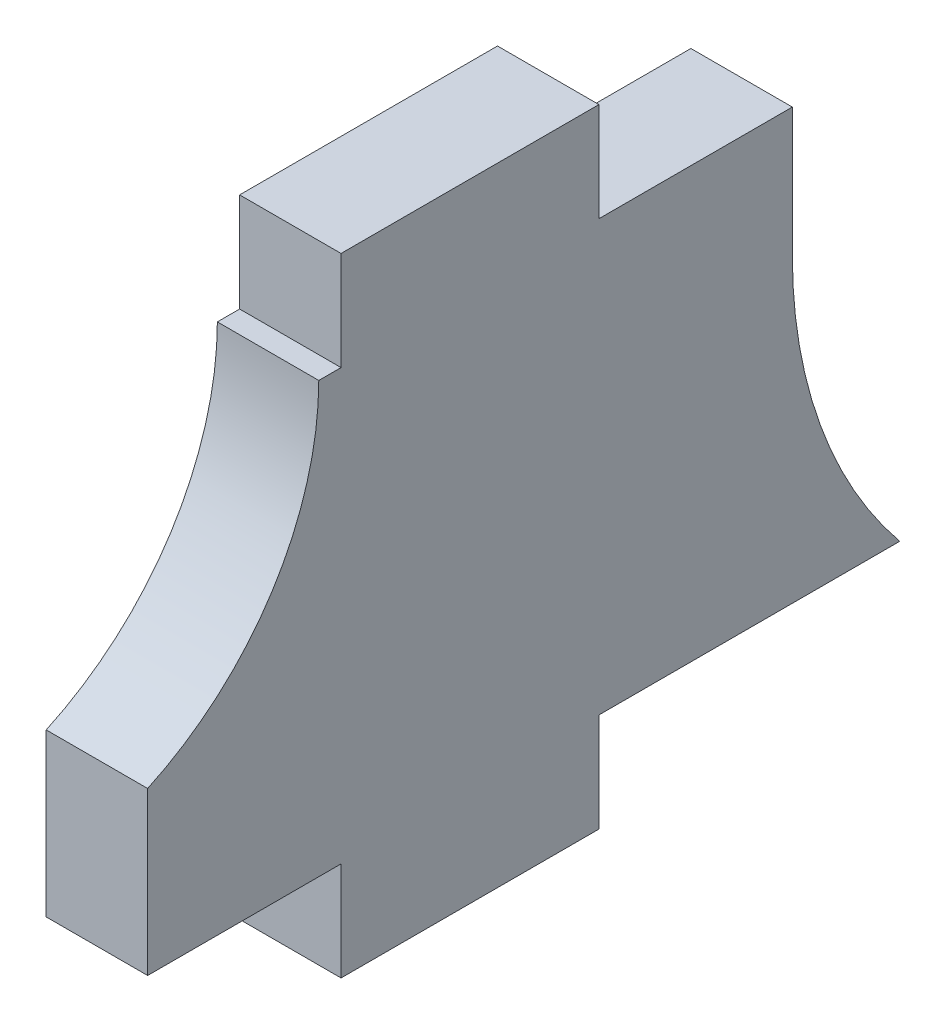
ISO-10303-21;
HEADER;
FILE_DESCRIPTION(('STEP AP214'),'2;1');
FILE_NAME('part.step','',(''),(''),'','','');
FILE_SCHEMA(('AUTOMOTIVE_DESIGN { 1 0 10303 214 1 1 1 1 }'));
ENDSEC;
DATA;
#1=APPLICATION_CONTEXT('core data for automotive mechanical design processes');
#2=APPLICATION_PROTOCOL_DEFINITION('international standard','automotive_design',2000,#1);
#3=PRODUCT_CONTEXT('',#1,'mechanical');
#4=PRODUCT('Part','Part','',(#3));
#5=PRODUCT_RELATED_PRODUCT_CATEGORY('part','',(#4));
#6=PRODUCT_DEFINITION_FORMATION('','',#4);
#7=PRODUCT_DEFINITION_CONTEXT('part definition',#1,'design');
#8=PRODUCT_DEFINITION('design','',#6,#7);
#9=PRODUCT_DEFINITION_SHAPE('','',#8);
#10=(LENGTH_UNIT() NAMED_UNIT(*) SI_UNIT(.MILLI.,.METRE.));
#11=(NAMED_UNIT(*) PLANE_ANGLE_UNIT() SI_UNIT($,.RADIAN.));
#12=(NAMED_UNIT(*) SI_UNIT($,.STERADIAN.) SOLID_ANGLE_UNIT());
#13=UNCERTAINTY_MEASURE_WITH_UNIT(LENGTH_MEASURE(1.E-05),#10,'distance_accuracy_value','');
#14=(GEOMETRIC_REPRESENTATION_CONTEXT(3) GLOBAL_UNCERTAINTY_ASSIGNED_CONTEXT((#13)) GLOBAL_UNIT_ASSIGNED_CONTEXT((#10,
#11,#12)) REPRESENTATION_CONTEXT('',''));
#15=CARTESIAN_POINT('',(0.,0.,0.));
#16=DIRECTION('',(0.,0.,1.));
#17=DIRECTION('',(1.,0.,0.));
#18=AXIS2_PLACEMENT_3D('',#15,#16,#17);
#19=CARTESIAN_POINT('',(2.9972,10.3531475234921,-23.5659141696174));
#20=DIRECTION('',(-1.,0.,0.));
#21=DIRECTION('',(0.,0.,1.));
#22=AXIS2_PLACEMENT_3D('',#19,#20,#21);
#23=CYLINDRICAL_SURFACE('',#22,14.0409141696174);
#24=CARTESIAN_POINT('',(0.,10.3531475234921,-23.5659141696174));
#25=DIRECTION('',(1.,0.,0.));
#26=DIRECTION('',(0.,0.,-1.));
#27=AXIS2_PLACEMENT_3D('',#24,#25,#26);
#28=CIRCLE('',#27,14.0409141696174);
#29=CARTESIAN_POINT('',(0.,10.3531475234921,-9.525));
#30=VERTEX_POINT('',#29);
#31=CARTESIAN_POINT('',(0.,1.4605,-12.7));
#32=VERTEX_POINT('',#31);
#33=EDGE_CURVE('E166',#30,#32,#28,.T.);
#34=ORIENTED_EDGE('',*,*,#33,.F.);
#35=DIRECTION('',(-1.,0.,0.));
#36=VECTOR('',#35,1.);
#37=CARTESIAN_POINT('',(2.9972,10.3531475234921,-9.525));
#38=LINE('',#37,#36);
#39=CARTESIAN_POINT('',(2.9972,10.3531475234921,-9.525));
#40=VERTEX_POINT('',#39);
#41=EDGE_CURVE('E11',#40,#30,#38,.T.);
#42=ORIENTED_EDGE('',*,*,#41,.F.);
#43=CARTESIAN_POINT('',(2.9972,10.3531475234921,-23.5659141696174));
#44=DIRECTION('',(1.,0.,0.));
#45=DIRECTION('',(0.,0.,-1.));
#46=AXIS2_PLACEMENT_3D('',#43,#44,#45);
#47=CIRCLE('',#46,14.0409141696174);
#48=CARTESIAN_POINT('',(2.9972,1.4605,-12.7));
#49=VERTEX_POINT('',#48);
#50=EDGE_CURVE('E260',#40,#49,#47,.T.);
#51=ORIENTED_EDGE('',*,*,#50,.T.);
#52=DIRECTION('',(-1.,0.,0.));
#53=VECTOR('',#52,1.);
#54=CARTESIAN_POINT('',(2.9972,1.4605,-12.7));
#55=LINE('',#54,#53);
#56=EDGE_CURVE('E51',#49,#32,#55,.T.);
#57=ORIENTED_EDGE('',*,*,#56,.T.);
#58=EDGE_LOOP('',(#34,#42,#51,#57));
#59=FACE_BOUND('',#58,.T.);
#60=ADVANCED_FACE('F35',(#59),#23,.F.);
#61=CARTESIAN_POINT('',(2.9972,0.,-9.525));
#62=DIRECTION('',(0.,0.,1.));
#63=DIRECTION('',(1.,0.,0.));
#64=AXIS2_PLACEMENT_3D('',#61,#62,#63);
#65=PLANE('',#64);
#66=DIRECTION('',(0.,1.,0.));
#67=VECTOR('',#66,1.);
#68=CARTESIAN_POINT('',(0.,0.,-9.525));
#69=LINE('',#68,#67);
#70=CARTESIAN_POINT('',(0.,14.1605,-9.525));
#71=VERTEX_POINT('',#70);
#72=EDGE_CURVE('E168',#30,#71,#69,.T.);
#73=ORIENTED_EDGE('',*,*,#72,.T.);
#74=DIRECTION('',(-1.,0.,0.));
#75=VECTOR('',#74,1.);
#76=CARTESIAN_POINT('',(2.9972,14.1605,-9.525));
#77=LINE('',#76,#75);
#78=CARTESIAN_POINT('',(2.9972,14.1605,-9.525));
#79=VERTEX_POINT('',#78);
#80=EDGE_CURVE('E43',#79,#71,#77,.T.);
#81=ORIENTED_EDGE('',*,*,#80,.F.);
#82=DIRECTION('',(0.,1.,0.));
#83=VECTOR('',#82,1.);
#84=CARTESIAN_POINT('',(2.9972,0.,-9.525));
#85=LINE('',#84,#83);
#86=EDGE_CURVE('E243',#40,#79,#85,.T.);
#87=ORIENTED_EDGE('',*,*,#86,.F.);
#88=ORIENTED_EDGE('',*,*,#41,.T.);
#89=EDGE_LOOP('',(#73,#81,#87,#88));
#90=FACE_BOUND('',#89,.T.);
#91=ADVANCED_FACE('F262',(#90),#65,.F.);
#92=CARTESIAN_POINT('',(2.9972,14.1605,0.));
#93=DIRECTION('',(0.,-1.,0.));
#94=DIRECTION('',(0.,0.,-1.));
#95=AXIS2_PLACEMENT_3D('',#92,#93,#94);
#96=PLANE('',#95);
#97=DIRECTION('',(0.,0.,1.));
#98=VECTOR('',#97,1.);
#99=CARTESIAN_POINT('',(0.,14.1605,0.));
#100=LINE('',#99,#98);
#101=CARTESIAN_POINT('',(0.,14.1605,-3.81000000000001));
#102=VERTEX_POINT('',#101);
#103=EDGE_CURVE('E170',#71,#102,#100,.T.);
#104=ORIENTED_EDGE('',*,*,#103,.T.);
#105=DIRECTION('',(-1.,0.,0.));
#106=VECTOR('',#105,1.);
#107=CARTESIAN_POINT('',(2.9972,14.1605,-3.81000000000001));
#108=LINE('',#107,#106);
#109=CARTESIAN_POINT('',(2.9972,14.1605,-3.81000000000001));
#110=VERTEX_POINT('',#109);
#111=EDGE_CURVE('E216',#110,#102,#108,.T.);
#112=ORIENTED_EDGE('',*,*,#111,.F.);
#113=DIRECTION('',(0.,0.,1.));
#114=VECTOR('',#113,1.);
#115=CARTESIAN_POINT('',(2.9972,14.1605,0.));
#116=LINE('',#115,#114);
#117=EDGE_CURVE('E224',#79,#110,#116,.T.);
#118=ORIENTED_EDGE('',*,*,#117,.F.);
#119=ORIENTED_EDGE('',*,*,#80,.T.);
#120=EDGE_LOOP('',(#104,#112,#118,#119));
#121=FACE_BOUND('',#120,.T.);
#122=ADVANCED_FACE('F222',(#121),#96,.F.);
#123=CARTESIAN_POINT('',(2.9972,0.,-3.81000000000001));
#124=DIRECTION('',(0.,0.,-1.));
#125=DIRECTION('',(-1.,0.,0.));
#126=AXIS2_PLACEMENT_3D('',#123,#124,#125);
#127=PLANE('',#126);
#128=DIRECTION('',(0.,-1.,0.));
#129=VECTOR('',#128,1.);
#130=CARTESIAN_POINT('',(0.,0.,-3.81000000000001));
#131=LINE('',#130,#129);
#132=CARTESIAN_POINT('',(0.,17.0815,-3.81000000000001));
#133=VERTEX_POINT('',#132);
#134=EDGE_CURVE('E173',#133,#102,#131,.T.);
#135=ORIENTED_EDGE('',*,*,#134,.F.);
#136=DIRECTION('',(-1.,0.,0.));
#137=VECTOR('',#136,1.);
#138=CARTESIAN_POINT('',(2.9972,17.0815,-3.81000000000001));
#139=LINE('',#138,#137);
#140=CARTESIAN_POINT('',(2.9972,17.0815,-3.81000000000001));
#141=VERTEX_POINT('',#140);
#142=EDGE_CURVE('E214',#141,#133,#139,.T.);
#143=ORIENTED_EDGE('',*,*,#142,.F.);
#144=DIRECTION('',(0.,-1.,0.));
#145=VECTOR('',#144,1.);
#146=CARTESIAN_POINT('',(2.9972,0.,-3.81000000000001));
#147=LINE('',#146,#145);
#148=EDGE_CURVE('E236',#141,#110,#147,.T.);
#149=ORIENTED_EDGE('',*,*,#148,.T.);
#150=ORIENTED_EDGE('',*,*,#111,.T.);
#151=EDGE_LOOP('',(#135,#143,#149,#150));
#152=FACE_BOUND('',#151,.T.);
#153=ADVANCED_FACE('F233',(#152),#127,.T.);
#154=CARTESIAN_POINT('',(2.9972,17.0815,0.));
#155=DIRECTION('',(0.,1.,0.));
#156=DIRECTION('',(0.,0.,1.));
#157=AXIS2_PLACEMENT_3D('',#154,#155,#156);
#158=PLANE('',#157);
#159=DIRECTION('',(0.,0.,-1.));
#160=VECTOR('',#159,1.);
#161=CARTESIAN_POINT('',(0.,17.0815,0.));
#162=LINE('',#161,#160);
#163=CARTESIAN_POINT('',(0.,17.0815,3.80999999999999));
#164=VERTEX_POINT('',#163);
#165=EDGE_CURVE('E177',#164,#133,#162,.T.);
#166=ORIENTED_EDGE('',*,*,#165,.F.);
#167=DIRECTION('',(-1.,0.,0.));
#168=VECTOR('',#167,1.);
#169=CARTESIAN_POINT('',(2.9972,17.0815,3.80999999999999));
#170=LINE('',#169,#168);
#171=CARTESIAN_POINT('',(2.9972,17.0815,3.80999999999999));
#172=VERTEX_POINT('',#171);
#173=EDGE_CURVE('E212',#172,#164,#170,.T.);
#174=ORIENTED_EDGE('',*,*,#173,.F.);
#175=DIRECTION('',(0.,0.,-1.));
#176=VECTOR('',#175,1.);
#177=CARTESIAN_POINT('',(2.9972,17.0815,0.));
#178=LINE('',#177,#176);
#179=EDGE_CURVE('E239',#172,#141,#178,.T.);
#180=ORIENTED_EDGE('',*,*,#179,.T.);
#181=ORIENTED_EDGE('',*,*,#142,.T.);
#182=EDGE_LOOP('',(#166,#174,#180,#181));
#183=FACE_BOUND('',#182,.T.);
#184=ADVANCED_FACE('F273',(#183),#158,.T.);
#185=CARTESIAN_POINT('',(2.9972,0.,3.80999999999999));
#186=DIRECTION('',(0.,0.,-1.));
#187=DIRECTION('',(-1.,0.,0.));
#188=AXIS2_PLACEMENT_3D('',#185,#186,#187);
#189=PLANE('',#188);
#190=DIRECTION('',(0.,-1.,0.));
#191=VECTOR('',#190,1.);
#192=CARTESIAN_POINT('',(0.,0.,3.80999999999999));
#193=LINE('',#192,#191);
#194=CARTESIAN_POINT('',(0.,14.1605,3.80999999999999));
#195=VERTEX_POINT('',#194);
#196=EDGE_CURVE('E180',#164,#195,#193,.T.);
#197=ORIENTED_EDGE('',*,*,#196,.T.);
#198=DIRECTION('',(-1.,0.,0.));
#199=VECTOR('',#198,1.);
#200=CARTESIAN_POINT('',(2.9972,14.1605,3.80999999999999));
#201=LINE('',#200,#199);
#202=CARTESIAN_POINT('',(2.9972,14.1605,3.80999999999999));
#203=VERTEX_POINT('',#202);
#204=EDGE_CURVE('E209',#203,#195,#201,.T.);
#205=ORIENTED_EDGE('',*,*,#204,.F.);
#206=DIRECTION('',(0.,-1.,0.));
#207=VECTOR('',#206,1.);
#208=CARTESIAN_POINT('',(2.9972,0.,3.80999999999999));
#209=LINE('',#208,#207);
#210=EDGE_CURVE('E241',#172,#203,#209,.T.);
#211=ORIENTED_EDGE('',*,*,#210,.F.);
#212=ORIENTED_EDGE('',*,*,#173,.T.);
#213=EDGE_LOOP('',(#197,#205,#211,#212));
#214=FACE_BOUND('',#213,.T.);
#215=ADVANCED_FACE('F276',(#214),#189,.F.);
#216=CARTESIAN_POINT('',(0.,14.1605,4.46810387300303));
#217=VERTEX_POINT('',#216);
#218=EDGE_CURVE('E174',#195,#217,#100,.T.);
#219=ORIENTED_EDGE('',*,*,#218,.T.);
#220=DIRECTION('',(-1.,0.,0.));
#221=VECTOR('',#220,1.);
#222=CARTESIAN_POINT('',(2.9972,14.1605,4.46810387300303));
#223=LINE('',#222,#221);
#224=CARTESIAN_POINT('',(2.9972,14.1605,4.46810387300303));
#225=VERTEX_POINT('',#224);
#226=EDGE_CURVE('E207',#225,#217,#223,.T.);
#227=ORIENTED_EDGE('',*,*,#226,.F.);
#228=EDGE_CURVE('E245',#203,#225,#116,.T.);
#229=ORIENTED_EDGE('',*,*,#228,.F.);
#230=ORIENTED_EDGE('',*,*,#204,.T.);
#231=EDGE_LOOP('',(#219,#227,#229,#230));
#232=FACE_BOUND('',#231,.T.);
#233=ADVANCED_FACE('F269',(#232),#96,.F.);
#234=CARTESIAN_POINT('',(2.9972,14.1605,13.1883593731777));
#235=DIRECTION('',(-1.,0.,0.));
#236=DIRECTION('',(0.,0.,1.));
#237=AXIS2_PLACEMENT_3D('',#234,#235,#236);
#238=CYLINDRICAL_SURFACE('',#237,8.72025550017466);
#239=CARTESIAN_POINT('',(0.,14.1605,13.1883593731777));
#240=DIRECTION('',(1.,0.,0.));
#241=DIRECTION('',(0.,0.,-1.));
#242=AXIS2_PLACEMENT_3D('',#239,#240,#241);
#243=CIRCLE('',#242,8.72025550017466);
#244=CARTESIAN_POINT('',(0.,6.24705232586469,9.52499999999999));
#245=VERTEX_POINT('',#244);
#246=EDGE_CURVE('E182',#245,#217,#243,.T.);
#247=ORIENTED_EDGE('',*,*,#246,.F.);
#248=DIRECTION('',(-1.,0.,0.));
#249=VECTOR('',#248,1.);
#250=CARTESIAN_POINT('',(2.9972,6.24705232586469,9.52499999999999));
#251=LINE('',#250,#249);
#252=CARTESIAN_POINT('',(2.9972,6.24705232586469,9.52499999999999));
#253=VERTEX_POINT('',#252);
#254=EDGE_CURVE('E205',#253,#245,#251,.T.);
#255=ORIENTED_EDGE('',*,*,#254,.F.);
#256=CARTESIAN_POINT('',(2.9972,14.1605,13.1883593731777));
#257=DIRECTION('',(1.,0.,0.));
#258=DIRECTION('',(0.,0.,-1.));
#259=AXIS2_PLACEMENT_3D('',#256,#257,#258);
#260=CIRCLE('',#259,8.72025550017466);
#261=EDGE_CURVE('E249',#253,#225,#260,.T.);
#262=ORIENTED_EDGE('',*,*,#261,.T.);
#263=ORIENTED_EDGE('',*,*,#226,.T.);
#264=EDGE_LOOP('',(#247,#255,#262,#263));
#265=FACE_BOUND('',#264,.T.);
#266=ADVANCED_FACE('F282',(#265),#238,.F.);
#267=CARTESIAN_POINT('',(2.9972,0.,9.52499999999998));
#268=DIRECTION('',(0.,0.,1.));
#269=DIRECTION('',(0.,-1.,0.));
#270=AXIS2_PLACEMENT_3D('',#267,#268,#269);
#271=PLANE('',#270);
#272=DIRECTION('',(0.,1.,0.));
#273=VECTOR('',#272,1.);
#274=CARTESIAN_POINT('',(0.,0.,9.52499999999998));
#275=LINE('',#274,#273);
#276=CARTESIAN_POINT('',(0.,1.4605,9.52499999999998));
#277=VERTEX_POINT('',#276);
#278=EDGE_CURVE('E185',#277,#245,#275,.T.);
#279=ORIENTED_EDGE('',*,*,#278,.F.);
#280=DIRECTION('',(-1.,0.,0.));
#281=VECTOR('',#280,1.);
#282=CARTESIAN_POINT('',(2.9972,1.4605,9.52499999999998));
#283=LINE('',#282,#281);
#284=CARTESIAN_POINT('',(2.9972,1.4605,9.52499999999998));
#285=VERTEX_POINT('',#284);
#286=EDGE_CURVE('E203',#285,#277,#283,.T.);
#287=ORIENTED_EDGE('',*,*,#286,.F.);
#288=DIRECTION('',(0.,1.,0.));
#289=VECTOR('',#288,1.);
#290=CARTESIAN_POINT('',(2.9972,0.,9.52499999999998));
#291=LINE('',#290,#289);
#292=EDGE_CURVE('E252',#285,#253,#291,.T.);
#293=ORIENTED_EDGE('',*,*,#292,.T.);
#294=ORIENTED_EDGE('',*,*,#254,.T.);
#295=EDGE_LOOP('',(#279,#287,#293,#294));
#296=FACE_BOUND('',#295,.T.);
#297=ADVANCED_FACE('F286',(#296),#271,.T.);
#298=CARTESIAN_POINT('',(2.9972,1.4605,0.));
#299=DIRECTION('',(0.,-1.,0.));
#300=DIRECTION('',(0.,0.,-1.));
#301=AXIS2_PLACEMENT_3D('',#298,#299,#300);
#302=PLANE('',#301);
#303=DIRECTION('',(0.,0.,1.));
#304=VECTOR('',#303,1.);
#305=CARTESIAN_POINT('',(0.,1.4605,0.));
#306=LINE('',#305,#304);
#307=CARTESIAN_POINT('',(0.,1.4605,3.80999999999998));
#308=VERTEX_POINT('',#307);
#309=EDGE_CURVE('E188',#308,#277,#306,.T.);
#310=ORIENTED_EDGE('',*,*,#309,.F.);
#311=DIRECTION('',(-1.,0.,0.));
#312=VECTOR('',#311,1.);
#313=CARTESIAN_POINT('',(2.9972,1.4605,3.80999999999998));
#314=LINE('',#313,#312);
#315=CARTESIAN_POINT('',(2.9972,1.4605,3.80999999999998));
#316=VERTEX_POINT('',#315);
#317=EDGE_CURVE('E201',#316,#308,#314,.T.);
#318=ORIENTED_EDGE('',*,*,#317,.F.);
#319=DIRECTION('',(0.,0.,1.));
#320=VECTOR('',#319,1.);
#321=CARTESIAN_POINT('',(2.9972,1.4605,0.));
#322=LINE('',#321,#320);
#323=EDGE_CURVE('E163',#316,#285,#322,.T.);
#324=ORIENTED_EDGE('',*,*,#323,.T.);
#325=ORIENTED_EDGE('',*,*,#286,.T.);
#326=EDGE_LOOP('',(#310,#318,#324,#325));
#327=FACE_BOUND('',#326,.T.);
#328=ADVANCED_FACE('F290',(#327),#302,.T.);
#329=CARTESIAN_POINT('',(2.9972,0.,3.80999999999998));
#330=DIRECTION('',(0.,0.,1.));
#331=DIRECTION('',(1.,0.,0.));
#332=AXIS2_PLACEMENT_3D('',#329,#330,#331);
#333=PLANE('',#332);
#334=DIRECTION('',(0.,1.,0.));
#335=VECTOR('',#334,1.);
#336=CARTESIAN_POINT('',(0.,0.,3.80999999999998));
#337=LINE('',#336,#335);
#338=CARTESIAN_POINT('',(0.,-1.4605,3.80999999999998));
#339=VERTEX_POINT('',#338);
#340=EDGE_CURVE('E191',#339,#308,#337,.T.);
#341=ORIENTED_EDGE('',*,*,#340,.F.);
#342=DIRECTION('',(-1.,0.,0.));
#343=VECTOR('',#342,1.);
#344=CARTESIAN_POINT('',(2.9972,-1.4605,3.80999999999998));
#345=LINE('',#344,#343);
#346=CARTESIAN_POINT('',(2.9972,-1.4605,3.80999999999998));
#347=VERTEX_POINT('',#346);
#348=EDGE_CURVE('E157',#347,#339,#345,.T.);
#349=ORIENTED_EDGE('',*,*,#348,.F.);
#350=DIRECTION('',(0.,1.,0.));
#351=VECTOR('',#350,1.);
#352=CARTESIAN_POINT('',(2.9972,0.,3.80999999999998));
#353=LINE('',#352,#351);
#354=EDGE_CURVE('E147',#347,#316,#353,.T.);
#355=ORIENTED_EDGE('',*,*,#354,.T.);
#356=ORIENTED_EDGE('',*,*,#317,.T.);
#357=EDGE_LOOP('',(#341,#349,#355,#356));
#358=FACE_BOUND('',#357,.T.);
#359=ADVANCED_FACE('F257',(#358),#333,.T.);
#360=CARTESIAN_POINT('',(2.9972,-1.4605,0.));
#361=DIRECTION('',(0.,1.,0.));
#362=DIRECTION('',(0.,0.,1.));
#363=AXIS2_PLACEMENT_3D('',#360,#361,#362);
#364=PLANE('',#363);
#365=DIRECTION('',(0.,0.,-1.));
#366=VECTOR('',#365,1.);
#367=CARTESIAN_POINT('',(0.,-1.4605,0.));
#368=LINE('',#367,#366);
#369=CARTESIAN_POINT('',(0.,-1.4605,-3.81000000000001));
#370=VERTEX_POINT('',#369);
#371=EDGE_CURVE('E154',#339,#370,#368,.T.);
#372=ORIENTED_EDGE('',*,*,#371,.T.);
#373=DIRECTION('',(-1.,0.,0.));
#374=VECTOR('',#373,1.);
#375=CARTESIAN_POINT('',(2.9972,-1.4605,-3.81000000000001));
#376=LINE('',#375,#374);
#377=CARTESIAN_POINT('',(2.9972,-1.4605,-3.81000000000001));
#378=VERTEX_POINT('',#377);
#379=EDGE_CURVE('E151',#378,#370,#376,.T.);
#380=ORIENTED_EDGE('',*,*,#379,.F.);
#381=DIRECTION('',(0.,0.,-1.));
#382=VECTOR('',#381,1.);
#383=CARTESIAN_POINT('',(2.9972,-1.4605,0.));
#384=LINE('',#383,#382);
#385=EDGE_CURVE('E138',#347,#378,#384,.T.);
#386=ORIENTED_EDGE('',*,*,#385,.F.);
#387=ORIENTED_EDGE('',*,*,#348,.T.);
#388=EDGE_LOOP('',(#372,#380,#386,#387));
#389=FACE_BOUND('',#388,.T.);
#390=ADVANCED_FACE('F152',(#389),#364,.F.);
#391=CARTESIAN_POINT('',(2.9972,0.,-3.81000000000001));
#392=DIRECTION('',(0.,0.,1.));
#393=DIRECTION('',(1.,0.,0.));
#394=AXIS2_PLACEMENT_3D('',#391,#392,#393);
#395=PLANE('',#394);
#396=DIRECTION('',(0.,1.,0.));
#397=VECTOR('',#396,1.);
#398=CARTESIAN_POINT('',(0.,0.,-3.81000000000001));
#399=LINE('',#398,#397);
#400=CARTESIAN_POINT('',(0.,1.4605,-3.81000000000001));
#401=VERTEX_POINT('',#400);
#402=EDGE_CURVE('E196',#370,#401,#399,.T.);
#403=ORIENTED_EDGE('',*,*,#402,.T.);
#404=DIRECTION('',(-1.,0.,0.));
#405=VECTOR('',#404,1.);
#406=CARTESIAN_POINT('',(2.9972,1.4605,-3.81000000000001));
#407=LINE('',#406,#405);
#408=CARTESIAN_POINT('',(2.9972,1.4605,-3.81000000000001));
#409=VERTEX_POINT('',#408);
#410=EDGE_CURVE('E95',#409,#401,#407,.T.);
#411=ORIENTED_EDGE('',*,*,#410,.F.);
#412=DIRECTION('',(0.,1.,0.));
#413=VECTOR('',#412,1.);
#414=CARTESIAN_POINT('',(2.9972,0.,-3.81000000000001));
#415=LINE('',#414,#413);
#416=EDGE_CURVE('E144',#378,#409,#415,.T.);
#417=ORIENTED_EDGE('',*,*,#416,.F.);
#418=ORIENTED_EDGE('',*,*,#379,.T.);
#419=EDGE_LOOP('',(#403,#411,#417,#418));
#420=FACE_BOUND('',#419,.T.);
#421=ADVANCED_FACE('F159',(#420),#395,.F.);
#422=EDGE_CURVE('E192',#32,#401,#306,.T.);
#423=ORIENTED_EDGE('',*,*,#422,.F.);
#424=ORIENTED_EDGE('',*,*,#56,.F.);
#425=EDGE_CURVE('E160',#49,#409,#322,.T.);
#426=ORIENTED_EDGE('',*,*,#425,.T.);
#427=ORIENTED_EDGE('',*,*,#410,.T.);
#428=EDGE_LOOP('',(#423,#424,#426,#427));
#429=FACE_BOUND('',#428,.T.);
#430=ADVANCED_FACE('F298',(#429),#302,.T.);
#431=CARTESIAN_POINT('',(2.9972,0.,0.));
#432=DIRECTION('',(1.,0.,0.));
#433=DIRECTION('',(0.,0.,-1.));
#434=AXIS2_PLACEMENT_3D('',#431,#432,#433);
#435=PLANE('',#434);
#436=ORIENTED_EDGE('',*,*,#50,.F.);
#437=ORIENTED_EDGE('',*,*,#86,.T.);
#438=ORIENTED_EDGE('',*,*,#117,.T.);
#439=ORIENTED_EDGE('',*,*,#148,.F.);
#440=ORIENTED_EDGE('',*,*,#179,.F.);
#441=ORIENTED_EDGE('',*,*,#210,.T.);
#442=ORIENTED_EDGE('',*,*,#228,.T.);
#443=ORIENTED_EDGE('',*,*,#261,.F.);
#444=ORIENTED_EDGE('',*,*,#292,.F.);
#445=ORIENTED_EDGE('',*,*,#323,.F.);
#446=ORIENTED_EDGE('',*,*,#354,.F.);
#447=ORIENTED_EDGE('',*,*,#385,.T.);
#448=ORIENTED_EDGE('',*,*,#416,.T.);
#449=ORIENTED_EDGE('',*,*,#425,.F.);
#450=EDGE_LOOP('',(#436,#437,#438,#439,#440,#441,#442,#443,#444,#445,#446,#447,#448,#449));
#451=FACE_BOUND('',#450,.T.);
#452=ADVANCED_FACE('F141',(#451),#435,.T.);
#453=CARTESIAN_POINT('',(0.,0.,0.));
#454=DIRECTION('',(1.,0.,0.));
#455=DIRECTION('',(0.,0.,-1.));
#456=AXIS2_PLACEMENT_3D('',#453,#454,#455);
#457=PLANE('',#456);
#458=ORIENTED_EDGE('',*,*,#33,.T.);
#459=ORIENTED_EDGE('',*,*,#422,.T.);
#460=ORIENTED_EDGE('',*,*,#402,.F.);
#461=ORIENTED_EDGE('',*,*,#371,.F.);
#462=ORIENTED_EDGE('',*,*,#340,.T.);
#463=ORIENTED_EDGE('',*,*,#309,.T.);
#464=ORIENTED_EDGE('',*,*,#278,.T.);
#465=ORIENTED_EDGE('',*,*,#246,.T.);
#466=ORIENTED_EDGE('',*,*,#218,.F.);
#467=ORIENTED_EDGE('',*,*,#196,.F.);
#468=ORIENTED_EDGE('',*,*,#165,.T.);
#469=ORIENTED_EDGE('',*,*,#134,.T.);
#470=ORIENTED_EDGE('',*,*,#103,.F.);
#471=ORIENTED_EDGE('',*,*,#72,.F.);
#472=EDGE_LOOP('',(#458,#459,#460,#461,#462,#463,#464,#465,#466,#467,#468,#469,#470,#471));
#473=FACE_BOUND('',#472,.T.);
#474=ADVANCED_FACE('F228',(#473),#457,.F.);
#475=CLOSED_SHELL('',(#60,#91,#122,#153,#184,#215,#233,#266,#297,#328,#359,#390,#421,#430,#452,#474));
#476=MANIFOLD_SOLID_BREP('B2',#475);
#477=ADVANCED_BREP_SHAPE_REPRESENTATION('',(#18,#476),#14);
#478=SHAPE_DEFINITION_REPRESENTATION(#9,#477);
ENDSEC;
END-ISO-10303-21;
